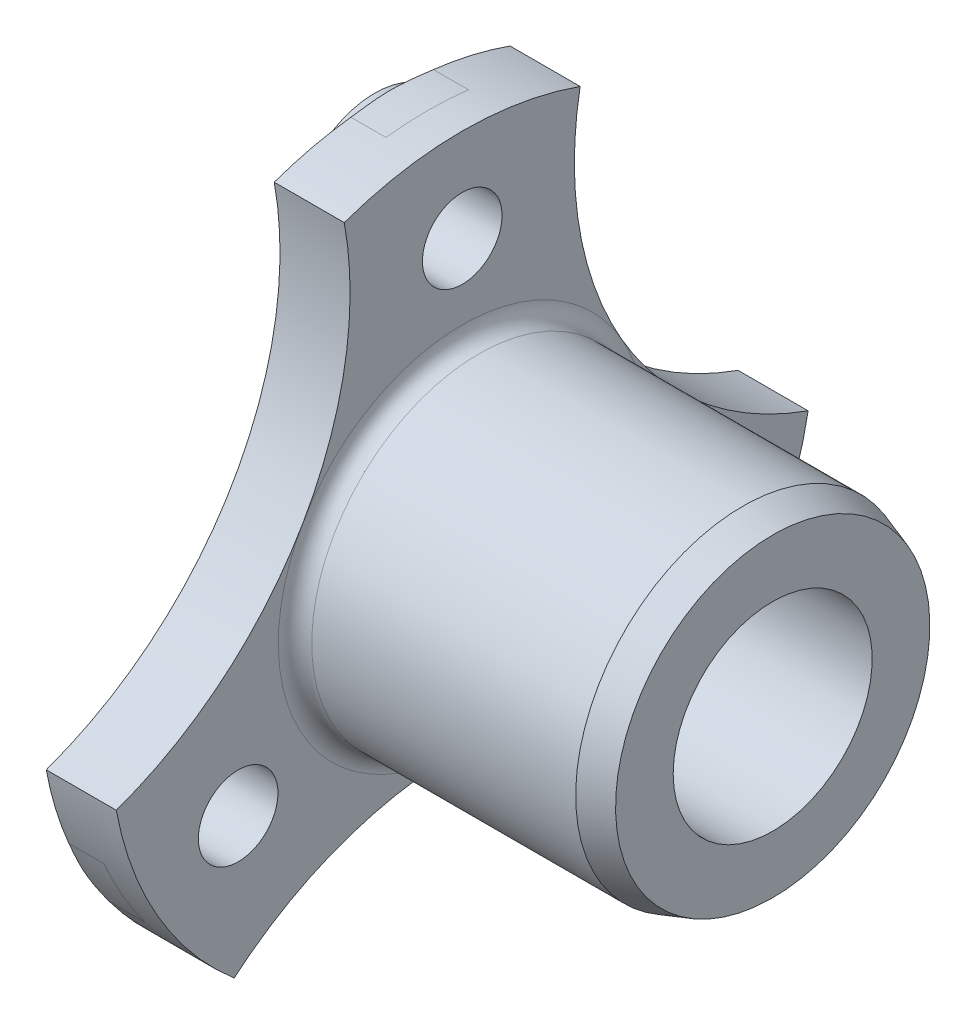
ISO-10303-21;
HEADER;
FILE_DESCRIPTION(('STEP AP214'),'2;1');
FILE_NAME('part.step','',(''),(''),'','','');
FILE_SCHEMA(('AUTOMOTIVE_DESIGN { 1 0 10303 214 1 1 1 1 }'));
ENDSEC;
DATA;
#1=APPLICATION_CONTEXT('core data for automotive mechanical design processes');
#2=APPLICATION_PROTOCOL_DEFINITION('international standard','automotive_design',2000,#1);
#3=PRODUCT_CONTEXT('',#1,'mechanical');
#4=PRODUCT('Part','Part','',(#3));
#5=PRODUCT_RELATED_PRODUCT_CATEGORY('part','',(#4));
#6=PRODUCT_DEFINITION_FORMATION('','',#4);
#7=PRODUCT_DEFINITION_CONTEXT('part definition',#1,'design');
#8=PRODUCT_DEFINITION('design','',#6,#7);
#9=PRODUCT_DEFINITION_SHAPE('','',#8);
#10=(LENGTH_UNIT() NAMED_UNIT(*) SI_UNIT(.MILLI.,.METRE.));
#11=(NAMED_UNIT(*) PLANE_ANGLE_UNIT() SI_UNIT($,.RADIAN.));
#12=(NAMED_UNIT(*) SI_UNIT($,.STERADIAN.) SOLID_ANGLE_UNIT());
#13=UNCERTAINTY_MEASURE_WITH_UNIT(LENGTH_MEASURE(1.E-05),#10,'distance_accuracy_value','');
#14=(GEOMETRIC_REPRESENTATION_CONTEXT(3) GLOBAL_UNCERTAINTY_ASSIGNED_CONTEXT((#13)) GLOBAL_UNIT_ASSIGNED_CONTEXT((#10,
#11,#12)) REPRESENTATION_CONTEXT('',''));
#15=CARTESIAN_POINT('',(0.,0.,0.));
#16=DIRECTION('',(0.,0.,1.));
#17=DIRECTION('',(1.,0.,0.));
#18=AXIS2_PLACEMENT_3D('',#15,#16,#17);
#19=CARTESIAN_POINT('',(15.,32.5,0.));
#20=DIRECTION('',(1.,0.,0.));
#21=DIRECTION('',(0.,0.,-1.));
#22=AXIS2_PLACEMENT_3D('',#19,#20,#21);
#23=TOROIDAL_SURFACE('',#22,12.5,2.2);
#24=CARTESIAN_POINT('',(15.,32.5,0.));
#25=DIRECTION('',(1.,0.,0.));
#26=DIRECTION('',(0.,0.,-1.));
#27=AXIS2_PLACEMENT_3D('',#24,#25,#26);
#28=CIRCLE('',#27,10.3);
#29=CARTESIAN_POINT('',(15.,32.5,-10.3));
#30=VERTEX_POINT('',#29);
#31=EDGE_CURVE('E347',#30,#30,#28,.T.);
#32=ORIENTED_EDGE('',*,*,#31,.T.);
#33=EDGE_LOOP('',(#32));
#34=FACE_BOUND('',#33,.T.);
#35=CARTESIAN_POINT('',(17.2,32.5,0.));
#36=DIRECTION('',(1.,0.,0.));
#37=DIRECTION('',(0.,1.,0.));
#38=AXIS2_PLACEMENT_3D('',#35,#36,#37);
#39=CIRCLE('',#38,12.5);
#40=CARTESIAN_POINT('',(17.2,43.87496,5.18269090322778));
#41=VERTEX_POINT('',#40);
#42=CARTESIAN_POINT('',(17.2,43.87496,-5.18269090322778));
#43=VERTEX_POINT('',#42);
#44=EDGE_CURVE('E206',#41,#43,#39,.T.);
#45=ORIENTED_EDGE('',*,*,#44,.F.);
#46=CARTESIAN_POINT('',(14.9999998,42.9543446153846,10.3342478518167));
#47=CARTESIAN_POINT('',(15.0340599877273,42.9543426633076,10.3342548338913));
#48=CARTESIAN_POINT('',(15.0681012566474,42.9547026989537,10.3327595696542));
#49=CARTESIAN_POINT('',(15.1358868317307,42.9561262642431,10.3268403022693));
#50=CARTESIAN_POINT('',(15.1696313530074,42.9571892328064,10.3224186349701));
#51=CARTESIAN_POINT('',(15.2695065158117,42.9613773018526,10.304979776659));
#52=CARTESIAN_POINT('',(15.3349036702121,42.9655023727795,10.2877856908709));
#53=CARTESIAN_POINT('',(15.4618106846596,42.9760435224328,10.2436606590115));
#54=CARTESIAN_POINT('',(15.5233312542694,42.9824529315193,10.2167580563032));
#55=CARTESIAN_POINT('',(15.6420208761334,42.9971170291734,10.154868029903));
#56=CARTESIAN_POINT('',(15.6991802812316,43.0053756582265,10.1198633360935));
#57=CARTESIAN_POINT('',(15.8454694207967,43.0292930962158,10.0178134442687));
#58=CARTESIAN_POINT('',(15.9303701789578,43.0462035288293,9.94501146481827));
#59=CARTESIAN_POINT('',(16.0876960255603,43.0823088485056,9.78742264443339));
#60=CARTESIAN_POINT('',(16.1600805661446,43.1015108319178,9.70259841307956));
#61=CARTESIAN_POINT('',(16.2844044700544,43.1383352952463,9.5374300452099));
#62=CARTESIAN_POINT('',(16.3377873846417,43.155803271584,9.45811757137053));
#63=CARTESIAN_POINT('',(16.4373941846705,43.1911926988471,9.29517245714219));
#64=CARTESIAN_POINT('',(16.4836125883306,43.2091144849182,9.21153657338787));
#65=CARTESIAN_POINT('',(16.5697502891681,43.2450908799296,9.0411337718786));
#66=CARTESIAN_POINT('',(16.6096691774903,43.2631454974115,8.95436665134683));
#67=CARTESIAN_POINT('',(16.6839826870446,43.2991799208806,8.77846781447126));
#68=CARTESIAN_POINT('',(16.7183751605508,43.3171596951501,8.68933519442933));
#69=CARTESIAN_POINT('',(16.8156669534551,43.3715316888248,8.41532688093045));
#70=CARTESIAN_POINT('',(16.8708502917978,43.407553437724,8.22762660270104));
#71=CARTESIAN_POINT('',(16.9653131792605,43.4778141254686,7.84789838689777));
#72=CARTESIAN_POINT('',(17.0045749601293,43.512051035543,7.65586586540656));
#73=CARTESIAN_POINT('',(17.0705331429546,43.5784707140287,7.26829649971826));
#74=CARTESIAN_POINT('',(17.0971639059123,43.6106420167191,7.07274671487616));
#75=CARTESIAN_POINT('',(17.1293699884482,43.6570219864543,6.77840000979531));
#76=CARTESIAN_POINT('',(17.1388137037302,43.6721649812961,6.6801430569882));
#77=CARTESIAN_POINT('',(17.1553939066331,43.7018135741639,6.48334703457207));
#78=CARTESIAN_POINT('',(17.1625306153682,43.71631923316,6.38480799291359));
#79=CARTESIAN_POINT('',(17.1829598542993,43.7637128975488,6.055105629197));
#80=CARTESIAN_POINT('',(17.1916587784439,43.7951430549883,5.82344367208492));
#81=CARTESIAN_POINT('',(17.2006654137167,43.8543405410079,5.35947300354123));
#82=CARTESIAN_POINT('',(17.2009708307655,43.8821068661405,5.12716413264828));
#83=CARTESIAN_POINT('',(17.1956428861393,43.9339653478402,4.66196560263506));
#84=CARTESIAN_POINT('',(17.1900031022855,43.9580534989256,4.42907558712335));
#85=CARTESIAN_POINT('',(17.1750033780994,44.0025154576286,3.96305816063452));
#86=CARTESIAN_POINT('',(17.1656431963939,44.022889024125,3.72993073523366));
#87=CARTESIAN_POINT('',(17.1452238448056,44.0599623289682,3.26298694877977));
#88=CARTESIAN_POINT('',(17.13416127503,44.0766545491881,3.02917014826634));
#89=CARTESIAN_POINT('',(17.1122194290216,44.1063164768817,2.5612878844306));
#90=CARTESIAN_POINT('',(17.1013401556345,44.1192861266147,2.32722241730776));
#91=CARTESIAN_POINT('',(17.0814037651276,44.1414915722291,1.8590312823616));
#92=CARTESIAN_POINT('',(17.0723451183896,44.1507305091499,1.62490583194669));
#93=CARTESIAN_POINT('',(17.0573298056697,44.1654838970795,1.15643789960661));
#94=CARTESIAN_POINT('',(17.0513730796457,44.1709984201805,0.922095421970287));
#95=CARTESIAN_POINT('',(17.0434025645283,44.178292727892,0.453533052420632));
#96=CARTESIAN_POINT('',(17.0413845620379,44.1800765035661,0.219313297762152));
#97=CARTESIAN_POINT('',(17.0415611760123,44.1799184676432,-0.249124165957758));
#98=CARTESIAN_POINT('',(17.0437558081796,44.1779766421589,-0.483341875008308));
#99=CARTESIAN_POINT('',(17.0520527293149,44.1703683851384,-0.951764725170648));
#100=CARTESIAN_POINT('',(17.0581570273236,44.1647000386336,-1.18596979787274));
#101=CARTESIAN_POINT('',(17.07341822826,44.1496435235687,-1.65415716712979));
#102=CARTESIAN_POINT('',(17.0825751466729,44.1402553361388,-1.88813946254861));
#103=CARTESIAN_POINT('',(17.1026313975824,44.1177707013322,-2.35573140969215));
#104=CARTESIAN_POINT('',(17.1135298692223,44.1046760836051,-2.58934118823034));
#105=CARTESIAN_POINT('',(17.1354403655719,44.0747780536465,-3.05631803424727));
#106=CARTESIAN_POINT('',(17.1464523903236,44.0579746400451,-3.28968510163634));
#107=CARTESIAN_POINT('',(17.166719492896,44.0206633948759,-3.7561024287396));
#108=CARTESIAN_POINT('',(17.1759753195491,44.000157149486,-3.98915278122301));
#109=CARTESIAN_POINT('',(17.1906901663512,43.955432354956,-4.4550093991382));
#110=CARTESIAN_POINT('',(17.1961495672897,43.9312141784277,-4.68781568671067));
#111=CARTESIAN_POINT('',(17.2001641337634,43.8883448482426,-5.07033899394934));
#112=CARTESIAN_POINT('',(17.2004843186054,43.8707773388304,-5.22015782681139));
#113=CARTESIAN_POINT('',(17.1979650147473,43.8341126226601,-5.51957572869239));
#114=CARTESIAN_POINT('',(17.195125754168,43.8150155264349,-5.66917481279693));
#115=CARTESIAN_POINT('',(17.1855757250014,43.7752745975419,-5.96829381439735));
#116=CARTESIAN_POINT('',(17.1788587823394,43.7546283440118,-6.11781322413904));
#117=CARTESIAN_POINT('',(17.1607646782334,43.7118450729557,-6.41636516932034));
#118=CARTESIAN_POINT('',(17.1493874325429,43.6897080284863,-6.56539769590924));
#119=CARTESIAN_POINT('',(17.1184071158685,43.6396508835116,-6.89095707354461));
#120=CARTESIAN_POINT('',(17.097652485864,43.6114307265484,-7.06733246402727));
#121=CARTESIAN_POINT('',(17.046567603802,43.5530923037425,-7.41836824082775));
#122=CARTESIAN_POINT('',(17.0162396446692,43.5229744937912,-7.59302902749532));
#123=CARTESIAN_POINT('',(16.9439672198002,43.4611672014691,-7.93915349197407));
#124=CARTESIAN_POINT('',(16.9020566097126,43.4294825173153,-8.11062495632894));
#125=CARTESIAN_POINT('',(16.8039083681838,43.3648996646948,-8.44911000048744));
#126=CARTESIAN_POINT('',(16.7476871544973,43.3320029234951,-8.6161284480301));
#127=CARTESIAN_POINT('',(16.6370851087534,43.2757906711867,-8.89336086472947));
#128=CARTESIAN_POINT('',(16.5873241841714,43.2525973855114,-9.005430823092));
#129=CARTESIAN_POINT('',(16.4774182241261,43.2063769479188,-9.2246365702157));
#130=CARTESIAN_POINT('',(16.4172631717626,43.1833499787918,-9.33176747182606));
#131=CARTESIAN_POINT('',(16.2841080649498,43.1379636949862,-9.53938528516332));
#132=CARTESIAN_POINT('',(16.2110001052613,43.1156119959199,-9.63980577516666));
#133=CARTESIAN_POINT('',(16.0500882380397,43.0729491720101,-9.82866936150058));
#134=CARTESIAN_POINT('',(15.9623215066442,43.0526330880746,-9.91714175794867));
#135=CARTESIAN_POINT('',(15.8078521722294,43.0230651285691,-10.0444393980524));
#136=CARTESIAN_POINT('',(15.7462751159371,43.0125874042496,-10.08917395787));
#137=CARTESIAN_POINT('',(15.6170293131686,42.9936804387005,-10.1694412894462));
#138=CARTESIAN_POINT('',(15.5493649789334,42.9852497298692,-10.2049806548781));
#139=CARTESIAN_POINT('',(15.4168648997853,42.9719258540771,-10.2609318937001));
#140=CARTESIAN_POINT('',(15.3526011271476,42.9667370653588,-10.2826147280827));
#141=CARTESIAN_POINT('',(15.2213061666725,42.9589430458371,-10.3151302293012));
#142=CARTESIAN_POINT('',(15.1542821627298,42.9563315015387,-10.3259894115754));
#143=CARTESIAN_POINT('',(15.0579529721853,42.9546012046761,-10.3331805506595));
#144=CARTESIAN_POINT('',(15.0289709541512,42.9543394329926,-10.334267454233));
#145=CARTESIAN_POINT('',(14.9999998,42.9543446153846,-10.3342478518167));
#146=B_SPLINE_CURVE_WITH_KNOTS('',3,(#46,#47,#48,#49,#50,#51,#52,#53,#54,#55,#56,#57,#58,#59,
#60,#61,#62,#63,#64,#65,#66,#67,#68,#69,#70,#71,#72,#73,#74,#75,#76,#77,#78,#79,#80,#81,#82,#83,
#84,#85,#86,#87,#88,#89,#90,#91,#92,#93,#94,#95,#96,#97,#98,#99,#100,#101,#102,#103,#104,#105,
#106,#107,#108,#109,#110,#111,#112,#113,#114,#115,#116,#117,#118,#119,#120,#121,#122,#123,#124,
#125,#126,#127,#128,#129,#130,#131,#132,#133,#134,#135,#136,#137,#138,#139,#140,#141,#142,#143,
#144,#145),.UNSPECIFIED.,.F.,.F.,(4,2,2,2,2,2,2,2,2,2,2,2,2,2,2,2,2,2,2,2,2,2,2,2,2,2,2,2,2,2,2,
2,2,2,2,2,2,2,2,2,2,2,2,2,2,2,2,2,2,4),(0.,0.102110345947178,0.204139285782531,
0.406348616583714,0.607972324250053,0.810029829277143,1.14742165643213,1.48588682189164,
1.7770315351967,2.06839792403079,2.35978321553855,2.65128147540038,3.24704691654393,
3.843475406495,4.44297025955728,4.74254209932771,5.04208521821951,5.74365582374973,
6.44541817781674,7.1479393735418,7.85050615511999,8.55449471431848,9.25849419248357,
9.96189970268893,10.665291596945,11.3679306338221,12.0705722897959,12.7735752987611,
13.476581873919,14.1792420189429,14.8819024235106,15.5842625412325,16.2865522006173,
16.7390560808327,17.1915272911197,17.6447209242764,18.0979227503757,18.6371598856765,
19.1762679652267,19.7138166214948,20.2507513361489,20.6247296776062,20.9990704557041,
21.3766904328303,21.7533668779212,21.9832091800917,22.2128862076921,22.4161071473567,
22.6188290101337,22.7057547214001),.UNSPECIFIED.);
#147=EDGE_CURVE('E245',#41,#43,#146,.T.);
#148=ORIENTED_EDGE('',*,*,#147,.T.);
#149=EDGE_LOOP('',(#45,#148));
#150=FACE_BOUND('',#149,.T.);
#151=ADVANCED_FACE('F12',(#34,#150),#23,.F.);
#152=CARTESIAN_POINT('',(15.,-16.25,28.1458256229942));
#153=DIRECTION('',(1.,0.,0.));
#154=DIRECTION('',(0.,0.866025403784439,0.5));
#155=AXIS2_PLACEMENT_3D('',#152,#153,#154);
#156=TOROIDAL_SURFACE('',#155,12.5,2.2);
#157=CARTESIAN_POINT('',(15.,-16.25,28.1458256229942));
#158=DIRECTION('',(1.,0.,0.));
#159=DIRECTION('',(0.,0.866025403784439,0.5));
#160=AXIS2_PLACEMENT_3D('',#157,#158,#159);
#161=CIRCLE('',#160,10.3);
#162=CARTESIAN_POINT('',(15.,-7.32993834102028,33.2958256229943));
#163=VERTEX_POINT('',#162);
#164=EDGE_CURVE('E376',#163,#163,#161,.T.);
#165=ORIENTED_EDGE('',*,*,#164,.T.);
#166=EDGE_LOOP('',(#165));
#167=FACE_BOUND('',#166,.T.);
#168=CARTESIAN_POINT('',(17.2,-16.25,28.1458256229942));
#169=DIRECTION('',(1.,0.,0.));
#170=DIRECTION('',(0.,1.,0.));
#171=AXIS2_PLACEMENT_3D('',#168,#169,#170);
#172=CIRCLE('',#171,12.5);
#173=CARTESIAN_POINT('',(17.2,-26.4258219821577,35.4054844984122));
#174=VERTEX_POINT('',#173);
#175=CARTESIAN_POINT('',(17.2,-17.4491380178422,40.58817540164));
#176=VERTEX_POINT('',#175);
#177=EDGE_CURVE('E212',#174,#176,#172,.T.);
#178=ORIENTED_EDGE('',*,*,#177,.F.);
#179=CARTESIAN_POINT('',(16.8956573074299,-28.7500002,33.5456388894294));
#180=CARTESIAN_POINT('',(16.9314040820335,-28.6448602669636,33.6357532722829));
#181=CARTESIAN_POINT('',(16.9629279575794,-28.5385209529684,33.7260281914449));
#182=CARTESIAN_POINT('',(17.0186376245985,-28.3239515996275,33.9064256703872));
#183=CARTESIAN_POINT('',(17.0428294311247,-28.2157231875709,33.9965482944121));
#184=CARTESIAN_POINT('',(17.0849400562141,-27.9982139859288,34.1759011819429));
#185=CARTESIAN_POINT('',(17.1028873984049,-27.8889403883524,34.2651336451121));
#186=CARTESIAN_POINT('',(17.1335484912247,-27.6690813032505,34.4429141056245));
#187=CARTESIAN_POINT('',(17.1462610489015,-27.5584955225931,34.5314619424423));
#188=CARTESIAN_POINT('',(17.1776384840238,-27.2261027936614,34.7949910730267));
#189=CARTESIAN_POINT('',(17.1897217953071,-27.0026549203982,34.9686873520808));
#190=CARTESIAN_POINT('',(17.2014664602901,-26.5519748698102,35.31211535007));
#191=CARTESIAN_POINT('',(17.201108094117,-26.3247372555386,35.4818403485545));
#192=CARTESIAN_POINT('',(17.1934058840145,-25.9265930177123,35.7732893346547));
#193=CARTESIAN_POINT('',(17.1879006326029,-25.7563856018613,35.8960305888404));
#194=CARTESIAN_POINT('',(17.1740127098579,-25.4143161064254,36.1390225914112));
#195=CARTESIAN_POINT('',(17.1656299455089,-25.2424539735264,36.2592732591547));
#196=CARTESIAN_POINT('',(17.1474543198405,-24.8970306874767,36.4973187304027));
#197=CARTESIAN_POINT('',(17.1376609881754,-24.7234689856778,36.615112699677));
#198=CARTESIAN_POINT('',(17.1180174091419,-24.3746938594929,36.8482115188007));
#199=CARTESIAN_POINT('',(17.1081671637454,-24.1994804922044,36.963516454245));
#200=CARTESIAN_POINT('',(17.0896164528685,-23.8474194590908,37.1916250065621));
#201=CARTESIAN_POINT('',(17.0809157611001,-23.6705721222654,37.3044291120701));
#202=CARTESIAN_POINT('',(17.0656684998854,-23.3152199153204,37.527548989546));
#203=CARTESIAN_POINT('',(17.0591219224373,-23.1367150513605,37.6378647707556));
#204=CARTESIAN_POINT('',(17.0489265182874,-22.7781530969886,37.8559394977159));
#205=CARTESIAN_POINT('',(17.0452766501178,-22.5980965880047,37.9636993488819));
#206=CARTESIAN_POINT('',(17.0412818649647,-22.2364384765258,38.1766583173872));
#207=CARTESIAN_POINT('',(17.0409369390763,-22.0548368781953,38.2818574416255));
#208=CARTESIAN_POINT('',(17.0436029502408,-21.6885599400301,38.4905649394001));
#209=CARTESIAN_POINT('',(17.0466435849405,-21.503871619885,38.5940501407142));
#210=CARTESIAN_POINT('',(17.0557802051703,-21.1330865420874,38.7983228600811));
#211=CARTESIAN_POINT('',(17.0618761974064,-20.9469897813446,38.8991103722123));
#212=CARTESIAN_POINT('',(17.0764250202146,-20.5733724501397,39.0979993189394));
#213=CARTESIAN_POINT('',(17.0848787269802,-20.385851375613,39.196099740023));
#214=CARTESIAN_POINT('',(17.1031524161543,-20.0094713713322,39.389570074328));
#215=CARTESIAN_POINT('',(17.1129724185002,-19.8206124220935,39.4849399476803));
#216=CARTESIAN_POINT('',(17.1328170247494,-19.4407127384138,39.6733694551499));
#217=CARTESIAN_POINT('',(17.1428423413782,-19.2496660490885,39.766417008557));
#218=CARTESIAN_POINT('',(17.161669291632,-18.8662124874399,39.9497633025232));
#219=CARTESIAN_POINT('',(17.1704710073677,-18.673805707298,40.0400622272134));
#220=CARTESIAN_POINT('',(17.1853467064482,-18.2876864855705,40.2178825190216));
#221=CARTESIAN_POINT('',(17.19142175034,-18.0939745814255,40.3054049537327));
#222=CARTESIAN_POINT('',(17.1991859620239,-17.7051902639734,40.4776959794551));
#223=CARTESIAN_POINT('',(17.200874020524,-17.5101175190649,40.562463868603));
#224=CARTESIAN_POINT('',(17.199534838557,-17.3144229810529,40.6458258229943));
#225=B_SPLINE_CURVE_WITH_KNOTS('',3,(#179,#180,#181,#182,#183,#184,#185,#186,#187,#188,#189,
#190,#191,#192,#193,#194,#195,#196,#197,#198,#199,#200,#201,#202,#203,#204,#205,#206,#207,#208,
#209,#210,#211,#212,#213,#214,#215,#216,#217,#218,#219,#220,#221,#222,#223,#224),.UNSPECIFIED.,
.F.,.F.,(4,2,2,2,2,2,2,2,2,2,2,2,2,2,2,2,2,2,2,2,2,2,4),(0.,0.428867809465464,0.857382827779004,
1.28391394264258,1.71054220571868,2.55986049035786,3.41052499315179,4.04023702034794,
4.66996940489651,5.29991225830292,5.92983341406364,6.55963038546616,7.18942501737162,
7.81899311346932,8.44855951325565,9.08369219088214,9.71882626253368,10.3541966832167,
10.9895763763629,11.6277657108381,12.2659121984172,12.9038102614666,13.5418696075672),.UNSPECIFIED.);
#226=EDGE_CURVE('E239',#174,#176,#225,.T.);
#227=ORIENTED_EDGE('',*,*,#226,.T.);
#228=EDGE_LOOP('',(#178,#227));
#229=FACE_BOUND('',#228,.T.);
#230=ADVANCED_FACE('F253',(#167,#229),#156,.F.);
#231=CARTESIAN_POINT('',(15.,-16.25,-28.1458256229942));
#232=DIRECTION('',(1.,0.,0.));
#233=DIRECTION('',(0.,-0.866025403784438,0.5));
#234=AXIS2_PLACEMENT_3D('',#231,#232,#233);
#235=TOROIDAL_SURFACE('',#234,12.5,2.2);
#236=CARTESIAN_POINT('',(15.,-16.25,-28.1458256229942));
#237=DIRECTION('',(1.,0.,0.));
#238=DIRECTION('',(0.,-0.866025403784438,0.5));
#239=AXIS2_PLACEMENT_3D('',#236,#237,#238);
#240=CIRCLE('',#239,10.3);
#241=CARTESIAN_POINT('',(15.,-25.1700616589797,-22.9958256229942));
#242=VERTEX_POINT('',#241);
#243=EDGE_CURVE('E137',#242,#242,#240,.T.);
#244=ORIENTED_EDGE('',*,*,#243,.T.);
#245=EDGE_LOOP('',(#244));
#246=FACE_BOUND('',#245,.T.);
#247=CARTESIAN_POINT('',(17.2,-16.25,-28.1458256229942));
#248=DIRECTION('',(1.,0.,0.));
#249=DIRECTION('',(0.,1.,0.));
#250=AXIS2_PLACEMENT_3D('',#247,#248,#249);
#251=CIRCLE('',#250,12.5);
#252=CARTESIAN_POINT('',(17.2,-17.4491380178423,-40.58817540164));
#253=VERTEX_POINT('',#252);
#254=CARTESIAN_POINT('',(17.2,-26.4258219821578,-35.4054844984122));
#255=VERTEX_POINT('',#254);
#256=EDGE_CURVE('E124',#253,#255,#251,.T.);
#257=ORIENTED_EDGE('',*,*,#256,.F.);
#258=CARTESIAN_POINT('',(17.199534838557,-17.3144229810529,-40.6458258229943));
#259=CARTESIAN_POINT('',(17.2006985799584,-17.4833212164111,-40.5738784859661));
#260=CARTESIAN_POINT('',(17.1995977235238,-17.6517622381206,-40.5008813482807));
#261=CARTESIAN_POINT('',(17.1939541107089,-17.9876433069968,-40.3528283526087));
#262=CARTESIAN_POINT('',(17.1894120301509,-18.1550835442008,-40.2777729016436));
#263=CARTESIAN_POINT('',(17.1779700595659,-18.489024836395,-40.1255785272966));
#264=CARTESIAN_POINT('',(17.1710690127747,-18.6555253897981,-40.0484385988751));
#265=CARTESIAN_POINT('',(17.155902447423,-18.9875093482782,-39.8921114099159));
#266=CARTESIAN_POINT('',(17.147636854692,-19.1529926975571,-39.8129240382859));
#267=CARTESIAN_POINT('',(17.1306530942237,-19.4833327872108,-39.6523133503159));
#268=CARTESIAN_POINT('',(17.1219338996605,-19.6481871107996,-39.5708851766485));
#269=CARTESIAN_POINT('',(17.1049198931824,-19.9768807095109,-39.4059696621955));
#270=CARTESIAN_POINT('',(17.0966250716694,-20.1407200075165,-39.3224823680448));
#271=CARTESIAN_POINT('',(17.0812240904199,-20.467276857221,-39.1535024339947));
#272=CARTESIAN_POINT('',(17.0741171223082,-20.6299950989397,-39.068011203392));
#273=CARTESIAN_POINT('',(17.0617124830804,-20.954411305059,-38.8949719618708));
#274=CARTESIAN_POINT('',(17.0564148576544,-21.1161092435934,-38.8074238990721));
#275=CARTESIAN_POINT('',(17.0484843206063,-21.4231262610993,-38.6387080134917));
#276=CARTESIAN_POINT('',(17.0456459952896,-21.5685413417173,-38.5577246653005));
#277=CARTESIAN_POINT('',(17.0420274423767,-21.8584678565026,-38.3941074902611));
#278=CARTESIAN_POINT('',(17.0412472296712,-22.0029792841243,-38.3114736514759));
#279=CARTESIAN_POINT('',(17.0418026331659,-22.2910579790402,-38.1445781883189));
#280=CARTESIAN_POINT('',(17.0431382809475,-22.4346252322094,-38.0603165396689));
#281=CARTESIAN_POINT('',(17.0478237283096,-22.7207747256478,-37.8901900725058));
#282=CARTESIAN_POINT('',(17.0511735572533,-22.8633569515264,-37.8043252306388));
#283=CARTESIAN_POINT('',(17.0639422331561,-23.290186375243,-37.5439857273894));
#284=CARTESIAN_POINT('',(17.0760775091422,-23.5728996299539,-37.367123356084));
#285=CARTESIAN_POINT('',(17.1042089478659,-24.1340918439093,-37.0071501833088));
#286=CARTESIAN_POINT('',(17.120205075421,-24.4125708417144,-36.8240394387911));
#287=CARTESIAN_POINT('',(17.1510503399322,-24.9624936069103,-36.4534647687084));
#288=CARTESIAN_POINT('',(17.1659096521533,-25.2339803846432,-36.2660656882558));
#289=CARTESIAN_POINT('',(17.1891467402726,-25.7729801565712,-35.8850228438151));
#290=CARTESIAN_POINT('',(17.1975224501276,-26.0404918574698,-35.6913771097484));
#291=CARTESIAN_POINT('',(17.2015490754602,-26.5703298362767,-35.2986999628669));
#292=CARTESIAN_POINT('',(17.1972447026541,-26.8326710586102,-35.0996899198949));
#293=CARTESIAN_POINT('',(17.1758693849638,-27.2222068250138,-34.7972827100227));
#294=CARTESIAN_POINT('',(17.1662636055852,-27.3513462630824,-34.6958666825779));
#295=CARTESIAN_POINT('',(17.1410007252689,-27.6081161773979,-34.491900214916));
#296=CARTESIAN_POINT('',(17.1253448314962,-27.7357469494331,-34.3893500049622));
#297=CARTESIAN_POINT('',(17.0945733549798,-27.937837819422,-34.2251231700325));
#298=CARTESIAN_POINT('',(17.081810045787,-28.0128844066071,-34.1637244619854));
#299=CARTESIAN_POINT('',(17.0534021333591,-28.1622724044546,-34.040684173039));
#300=CARTESIAN_POINT('',(17.0377566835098,-28.2366136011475,-33.9790425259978));
#301=CARTESIAN_POINT('',(17.0031938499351,-28.3847307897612,-33.8554100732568));
#302=CARTESIAN_POINT('',(16.9842645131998,-28.4585036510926,-33.7934188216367));
#303=CARTESIAN_POINT('',(16.9427794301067,-28.6050447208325,-33.6694676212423));
#304=CARTESIAN_POINT('',(16.9202237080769,-28.6778129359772,-33.6075076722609));
#305=CARTESIAN_POINT('',(16.8956573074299,-28.7500002,-33.5456388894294));
#306=B_SPLINE_CURVE_WITH_KNOTS('',3,(#258,#259,#260,#261,#262,#263,#264,#265,#266,#267,#268,
#269,#270,#271,#272,#273,#274,#275,#276,#277,#278,#279,#280,#281,#282,#283,#284,#285,#286,#287,
#288,#289,#290,#291,#292,#293,#294,#295,#296,#297,#298,#299,#300,#301,#302,#303,#304,#305),
.UNSPECIFIED.,.F.,.F.,(4,2,2,2,2,2,2,2,2,2,2,2,2,2,2,2,2,2,2,2,2,2,2,4),(0.,0.550711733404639,
1.10131534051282,1.65218933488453,2.20309328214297,2.75530373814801,3.30750169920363,
3.85932232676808,4.41115688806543,4.91054155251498,5.40992983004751,5.90932556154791,
6.40872857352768,7.40967169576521,8.41060569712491,9.40115860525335,10.3920270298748,
11.379405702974,11.8727603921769,12.3660166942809,12.6593766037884,12.9528228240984,
13.2473604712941,13.5418961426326),.UNSPECIFIED.);
#307=EDGE_CURVE('E9',#253,#255,#306,.T.);
#308=ORIENTED_EDGE('',*,*,#307,.T.);
#309=EDGE_LOOP('',(#257,#308));
#310=FACE_BOUND('',#309,.T.);
#311=ADVANCED_FACE('F125',(#246,#310),#235,.F.);
#312=CARTESIAN_POINT('',(26.,16.82,-29.1330945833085));
#313=DIRECTION('',(1.,0.,0.));
#314=DIRECTION('',(0.,0.866025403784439,-0.5));
#315=AXIS2_PLACEMENT_3D('',#312,#313,#314);
#316=PLANE('',#315);
#317=CARTESIAN_POINT('',(26.,-16.25,-28.1458256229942));
#318=DIRECTION('',(1.,0.,0.));
#319=DIRECTION('',(0.,1.,0.));
#320=AXIS2_PLACEMENT_3D('',#317,#318,#319);
#321=CIRCLE('',#320,5.);
#322=CARTESIAN_POINT('',(26.,-11.25,-28.1458256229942));
#323=VERTEX_POINT('',#322);
#324=EDGE_CURVE('E401',#323,#323,#321,.T.);
#325=ORIENTED_EDGE('',*,*,#324,.F.);
#326=EDGE_LOOP('',(#325));
#327=FACE_BOUND('',#326,.T.);
#328=CARTESIAN_POINT('',(26.,33.64,-58.266189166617));
#329=DIRECTION('',(1.,0.,0.));
#330=DIRECTION('',(0.,0.5,0.866025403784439));
#331=AXIS2_PLACEMENT_3D('',#328,#329,#330);
#332=CIRCLE('',#331,44.18);
#333=CARTESIAN_POINT('',(26.,11.55,-20.0051868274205));
#334=VERTEX_POINT('',#333);
#335=CARTESIAN_POINT('',(26.,-7.98256236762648,-43.4528606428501));
#336=VERTEX_POINT('',#335);
#337=EDGE_CURVE('E165',#334,#336,#332,.T.);
#338=ORIENTED_EDGE('',*,*,#337,.F.);
#339=CARTESIAN_POINT('',(26.,0.,0.));
#340=DIRECTION('',(1.,0.,0.));
#341=DIRECTION('',(0.,0.866025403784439,-0.5));
#342=AXIS2_PLACEMENT_3D('',#339,#340,#341);
#343=CIRCLE('',#342,23.1);
#344=CARTESIAN_POINT('',(26.,-23.1,0.));
#345=VERTEX_POINT('',#344);
#346=EDGE_CURVE('E202',#334,#345,#343,.F.);
#347=ORIENTED_EDGE('',*,*,#346,.T.);
#348=CARTESIAN_POINT('',(26.,-67.28,0.));
#349=DIRECTION('',(1.,0.,0.));
#350=DIRECTION('',(0.,0.5,0.866025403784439));
#351=AXIS2_PLACEMENT_3D('',#348,#349,#350);
#352=CIRCLE('',#351,44.18);
#353=CARTESIAN_POINT('',(26.,-33.64,-28.6395321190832));
#354=VERTEX_POINT('',#353);
#355=EDGE_CURVE('E172',#354,#345,#352,.T.);
#356=ORIENTED_EDGE('',*,*,#355,.F.);
#357=CARTESIAN_POINT('',(26.,0.,0.));
#358=DIRECTION('',(1.,0.,0.));
#359=DIRECTION('',(0.,0.5,0.866025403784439));
#360=AXIS2_PLACEMENT_3D('',#357,#358,#359);
#361=CIRCLE('',#360,44.18);
#362=EDGE_CURVE('E167',#354,#336,#361,.T.);
#363=ORIENTED_EDGE('',*,*,#362,.T.);
#364=EDGE_LOOP('',(#338,#347,#356,#363));
#365=FACE_BOUND('',#364,.T.);
#366=ADVANCED_FACE('F289',(#327,#365),#316,.T.);
#367=CARTESIAN_POINT('',(26.,-16.25,28.1458256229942));
#368=DIRECTION('',(1.,0.,0.));
#369=DIRECTION('',(0.,1.,0.));
#370=AXIS2_PLACEMENT_3D('',#367,#368,#369);
#371=CIRCLE('',#370,5.);
#372=CARTESIAN_POINT('',(26.,-11.25,28.1458256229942));
#373=VERTEX_POINT('',#372);
#374=EDGE_CURVE('E396',#373,#373,#371,.T.);
#375=ORIENTED_EDGE('',*,*,#374,.F.);
#376=EDGE_LOOP('',(#375));
#377=FACE_BOUND('',#376,.T.);
#378=CARTESIAN_POINT('',(26.,-33.64,28.6395321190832));
#379=VERTEX_POINT('',#378);
#380=EDGE_CURVE('E170',#345,#379,#352,.T.);
#381=ORIENTED_EDGE('',*,*,#380,.F.);
#382=CARTESIAN_POINT('',(26.,11.55,20.0051868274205));
#383=VERTEX_POINT('',#382);
#384=EDGE_CURVE('E200',#345,#383,#343,.F.);
#385=ORIENTED_EDGE('',*,*,#384,.T.);
#386=CARTESIAN_POINT('',(26.,33.64,58.266189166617));
#387=DIRECTION('',(1.,0.,0.));
#388=DIRECTION('',(0.,0.5,0.866025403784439));
#389=AXIS2_PLACEMENT_3D('',#386,#387,#388);
#390=CIRCLE('',#389,44.18);
#391=CARTESIAN_POINT('',(26.,-7.98256236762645,43.4528606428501));
#392=VERTEX_POINT('',#391);
#393=EDGE_CURVE('E179',#392,#383,#390,.T.);
#394=ORIENTED_EDGE('',*,*,#393,.F.);
#395=CARTESIAN_POINT('',(26.,0.,0.));
#396=DIRECTION('',(1.,0.,0.));
#397=DIRECTION('',(0.,0.5,0.866025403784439));
#398=AXIS2_PLACEMENT_3D('',#395,#396,#397);
#399=CIRCLE('',#398,44.18);
#400=EDGE_CURVE('E175',#392,#379,#399,.T.);
#401=ORIENTED_EDGE('',*,*,#400,.T.);
#402=EDGE_LOOP('',(#381,#385,#394,#401));
#403=FACE_BOUND('',#402,.T.);
#404=ADVANCED_FACE('F292',(#377,#403),#316,.T.);
#405=CARTESIAN_POINT('',(26.,32.5,0.));
#406=DIRECTION('',(1.,0.,0.));
#407=DIRECTION('',(0.,1.,0.));
#408=AXIS2_PLACEMENT_3D('',#405,#406,#407);
#409=CIRCLE('',#408,5.);
#410=CARTESIAN_POINT('',(26.,37.5,0.));
#411=VERTEX_POINT('',#410);
#412=EDGE_CURVE('E246',#411,#411,#409,.T.);
#413=ORIENTED_EDGE('',*,*,#412,.F.);
#414=EDGE_LOOP('',(#413));
#415=FACE_BOUND('',#414,.T.);
#416=CARTESIAN_POINT('',(26.,41.6225623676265,14.8133285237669));
#417=VERTEX_POINT('',#416);
#418=EDGE_CURVE('E178',#383,#417,#390,.T.);
#419=ORIENTED_EDGE('',*,*,#418,.F.);
#420=CARTESIAN_POINT('',(26.,0.,0.));
#421=DIRECTION('',(-1.,0.,0.));
#422=DIRECTION('',(0.,-0.866025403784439,0.5));
#423=AXIS2_PLACEMENT_3D('',#420,#421,#422);
#424=CIRCLE('',#423,23.1);
#425=EDGE_CURVE('E357',#383,#334,#424,.T.);
#426=ORIENTED_EDGE('',*,*,#425,.T.);
#427=CARTESIAN_POINT('',(26.,41.6225623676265,-14.8133285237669));
#428=VERTEX_POINT('',#427);
#429=EDGE_CURVE('E171',#428,#334,#332,.T.);
#430=ORIENTED_EDGE('',*,*,#429,.F.);
#431=CARTESIAN_POINT('',(26.,0.,0.));
#432=DIRECTION('',(1.,0.,0.));
#433=DIRECTION('',(0.,0.5,0.866025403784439));
#434=AXIS2_PLACEMENT_3D('',#431,#432,#433);
#435=CIRCLE('',#434,44.18);
#436=EDGE_CURVE('E182',#428,#417,#435,.T.);
#437=ORIENTED_EDGE('',*,*,#436,.T.);
#438=EDGE_LOOP('',(#419,#426,#430,#437));
#439=FACE_BOUND('',#438,.T.);
#440=ADVANCED_FACE('F294',(#415,#439),#316,.T.);
#441=CARTESIAN_POINT('',(26.,33.64,-58.266189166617));
#442=DIRECTION('',(-1.,0.,0.));
#443=DIRECTION('',(0.,-0.866025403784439,0.5));
#444=AXIS2_PLACEMENT_3D('',#441,#442,#443);
#445=CYLINDRICAL_SURFACE('',#444,44.18);
#446=CARTESIAN_POINT('',(17.2,33.64,-58.266189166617));
#447=DIRECTION('',(1.,0.,0.));
#448=DIRECTION('',(0.,0.5,0.866025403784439));
#449=AXIS2_PLACEMENT_3D('',#446,#447,#448);
#450=CIRCLE('',#449,44.18);
#451=CARTESIAN_POINT('',(17.2,41.6225623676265,-14.8133285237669));
#452=VERTEX_POINT('',#451);
#453=CARTESIAN_POINT('',(17.2,-7.98256236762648,-43.4528606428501));
#454=VERTEX_POINT('',#453);
#455=EDGE_CURVE('E143',#452,#454,#450,.T.);
#456=ORIENTED_EDGE('',*,*,#455,.F.);
#457=DIRECTION('',(-1.,0.,0.));
#458=VECTOR('',#457,1.);
#459=CARTESIAN_POINT('',(26.,41.6225623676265,-14.8133285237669));
#460=LINE('',#459,#458);
#461=EDGE_CURVE('E185',#428,#452,#460,.T.);
#462=ORIENTED_EDGE('',*,*,#461,.F.);
#463=ORIENTED_EDGE('',*,*,#429,.T.);
#464=DIRECTION('',(-1.,0.,0.));
#465=VECTOR('',#464,1.);
#466=CARTESIAN_POINT('',(25.5,11.55,-20.0051868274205));
#467=LINE('',#466,#465);
#468=CARTESIAN_POINT('',(25.,11.55,-20.0051868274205));
#469=VERTEX_POINT('',#468);
#470=EDGE_CURVE('E151',#334,#469,#467,.T.);
#471=ORIENTED_EDGE('',*,*,#470,.T.);
#472=ORIENTED_EDGE('',*,*,#470,.F.);
#473=ORIENTED_EDGE('',*,*,#337,.T.);
#474=DIRECTION('',(-1.,0.,0.));
#475=VECTOR('',#474,1.);
#476=CARTESIAN_POINT('',(26.,-7.98256236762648,-43.4528606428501));
#477=LINE('',#476,#475);
#478=EDGE_CURVE('E198',#336,#454,#477,.T.);
#479=ORIENTED_EDGE('',*,*,#478,.T.);
#480=EDGE_LOOP('',(#456,#462,#463,#471,#472,#473,#479));
#481=FACE_BOUND('',#480,.T.);
#482=ADVANCED_FACE('F14',(#481),#445,.F.);
#483=CARTESIAN_POINT('',(26.,0.,0.));
#484=DIRECTION('',(-1.,0.,0.));
#485=DIRECTION('',(0.,-0.866025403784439,0.5));
#486=AXIS2_PLACEMENT_3D('',#483,#484,#485);
#487=CYLINDRICAL_SURFACE('',#486,44.18);
#488=CARTESIAN_POINT('',(17.2,0.,0.));
#489=DIRECTION('',(1.,0.,0.));
#490=DIRECTION('',(0.,0.5,0.866025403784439));
#491=AXIS2_PLACEMENT_3D('',#488,#489,#490);
#492=CIRCLE('',#491,44.18);
#493=CARTESIAN_POINT('',(17.2,-33.64,-28.6395321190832));
#494=VERTEX_POINT('',#493);
#495=EDGE_CURVE('E144',#494,#255,#492,.T.);
#496=ORIENTED_EDGE('',*,*,#495,.T.);
#497=DIRECTION('',(1.,0.,0.));
#498=VECTOR('',#497,1.);
#499=CARTESIAN_POINT('',(19.4,-26.4258219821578,-35.4054844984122));
#500=LINE('',#499,#498);
#501=CARTESIAN_POINT('',(21.6,-26.4258219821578,-35.4054844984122));
#502=VERTEX_POINT('',#501);
#503=EDGE_CURVE('E29',#255,#502,#500,.T.);
#504=ORIENTED_EDGE('',*,*,#503,.T.);
#505=CARTESIAN_POINT('',(21.6,0.,0.));
#506=DIRECTION('',(1.,0.,0.));
#507=DIRECTION('',(0.,1.,0.));
#508=AXIS2_PLACEMENT_3D('',#505,#506,#507);
#509=CIRCLE('',#508,44.18);
#510=CARTESIAN_POINT('',(21.6,-17.4491380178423,-40.58817540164));
#511=VERTEX_POINT('',#510);
#512=EDGE_CURVE('E21',#502,#511,#509,.T.);
#513=ORIENTED_EDGE('',*,*,#512,.T.);
#514=DIRECTION('',(1.,0.,0.));
#515=VECTOR('',#514,1.);
#516=CARTESIAN_POINT('',(19.4,-17.4491380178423,-40.58817540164));
#517=LINE('',#516,#515);
#518=EDGE_CURVE('E120',#511,#253,#517,.F.);
#519=ORIENTED_EDGE('',*,*,#518,.T.);
#520=EDGE_CURVE('E135',#253,#454,#492,.T.);
#521=ORIENTED_EDGE('',*,*,#520,.T.);
#522=ORIENTED_EDGE('',*,*,#478,.F.);
#523=ORIENTED_EDGE('',*,*,#362,.F.);
#524=DIRECTION('',(-1.,0.,0.));
#525=VECTOR('',#524,1.);
#526=CARTESIAN_POINT('',(26.,-33.64,-28.6395321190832));
#527=LINE('',#526,#525);
#528=EDGE_CURVE('E197',#354,#494,#527,.T.);
#529=ORIENTED_EDGE('',*,*,#528,.T.);
#530=EDGE_LOOP('',(#496,#504,#513,#519,#521,#522,#523,#529));
#531=FACE_BOUND('',#530,.T.);
#532=ADVANCED_FACE('F133',(#531),#487,.T.);
#533=CARTESIAN_POINT('',(26.,-67.28,0.));
#534=DIRECTION('',(-1.,0.,0.));
#535=DIRECTION('',(0.,-0.866025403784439,0.5));
#536=AXIS2_PLACEMENT_3D('',#533,#534,#535);
#537=CYLINDRICAL_SURFACE('',#536,44.18);
#538=CARTESIAN_POINT('',(17.2,-67.28,0.));
#539=DIRECTION('',(1.,0.,0.));
#540=DIRECTION('',(0.,0.5,0.866025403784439));
#541=AXIS2_PLACEMENT_3D('',#538,#539,#540);
#542=CIRCLE('',#541,44.18);
#543=CARTESIAN_POINT('',(17.2,-33.64,28.6395321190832));
#544=VERTEX_POINT('',#543);
#545=EDGE_CURVE('E146',#494,#544,#542,.T.);
#546=ORIENTED_EDGE('',*,*,#545,.F.);
#547=ORIENTED_EDGE('',*,*,#528,.F.);
#548=ORIENTED_EDGE('',*,*,#355,.T.);
#549=DIRECTION('',(-1.,0.,0.));
#550=VECTOR('',#549,1.);
#551=CARTESIAN_POINT('',(25.5,-23.1,0.));
#552=LINE('',#551,#550);
#553=CARTESIAN_POINT('',(25.,-23.1,0.));
#554=VERTEX_POINT('',#553);
#555=EDGE_CURVE('E326',#345,#554,#552,.T.);
#556=ORIENTED_EDGE('',*,*,#555,.T.);
#557=ORIENTED_EDGE('',*,*,#555,.F.);
#558=ORIENTED_EDGE('',*,*,#380,.T.);
#559=DIRECTION('',(-1.,0.,0.));
#560=VECTOR('',#559,1.);
#561=CARTESIAN_POINT('',(26.,-33.64,28.6395321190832));
#562=LINE('',#561,#560);
#563=EDGE_CURVE('E194',#379,#544,#562,.T.);
#564=ORIENTED_EDGE('',*,*,#563,.T.);
#565=EDGE_LOOP('',(#546,#547,#548,#556,#557,#558,#564));
#566=FACE_BOUND('',#565,.T.);
#567=ADVANCED_FACE('F305',(#566),#537,.F.);
#568=CARTESIAN_POINT('',(26.,0.,0.));
#569=DIRECTION('',(-1.,0.,0.));
#570=DIRECTION('',(0.,-0.866025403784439,0.5));
#571=AXIS2_PLACEMENT_3D('',#568,#569,#570);
#572=CYLINDRICAL_SURFACE('',#571,44.18);
#573=CARTESIAN_POINT('',(17.2,0.,0.));
#574=DIRECTION('',(1.,0.,0.));
#575=DIRECTION('',(0.,0.5,0.866025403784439));
#576=AXIS2_PLACEMENT_3D('',#573,#574,#575);
#577=CIRCLE('',#576,44.18);
#578=CARTESIAN_POINT('',(17.2,-7.98256236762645,43.4528606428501));
#579=VERTEX_POINT('',#578);
#580=EDGE_CURVE('E156',#579,#176,#577,.T.);
#581=ORIENTED_EDGE('',*,*,#580,.T.);
#582=DIRECTION('',(1.,0.,0.));
#583=VECTOR('',#582,1.);
#584=CARTESIAN_POINT('',(19.4,-17.4491380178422,40.58817540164));
#585=LINE('',#584,#583);
#586=CARTESIAN_POINT('',(21.6,-17.4491380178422,40.58817540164));
#587=VERTEX_POINT('',#586);
#588=EDGE_CURVE('E36',#176,#587,#585,.T.);
#589=ORIENTED_EDGE('',*,*,#588,.T.);
#590=CARTESIAN_POINT('',(21.6,0.,0.));
#591=DIRECTION('',(1.,0.,0.));
#592=DIRECTION('',(0.,1.,0.));
#593=AXIS2_PLACEMENT_3D('',#590,#591,#592);
#594=CIRCLE('',#593,44.18);
#595=CARTESIAN_POINT('',(21.6,-26.4258219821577,35.4054844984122));
#596=VERTEX_POINT('',#595);
#597=EDGE_CURVE('E130',#587,#596,#594,.T.);
#598=ORIENTED_EDGE('',*,*,#597,.T.);
#599=DIRECTION('',(1.,0.,0.));
#600=VECTOR('',#599,1.);
#601=CARTESIAN_POINT('',(19.4,-26.4258219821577,35.4054844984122));
#602=LINE('',#601,#600);
#603=EDGE_CURVE('E333',#596,#174,#602,.F.);
#604=ORIENTED_EDGE('',*,*,#603,.T.);
#605=EDGE_CURVE('E155',#174,#544,#577,.T.);
#606=ORIENTED_EDGE('',*,*,#605,.T.);
#607=ORIENTED_EDGE('',*,*,#563,.F.);
#608=ORIENTED_EDGE('',*,*,#400,.F.);
#609=DIRECTION('',(-1.,0.,0.));
#610=VECTOR('',#609,1.);
#611=CARTESIAN_POINT('',(26.,-7.98256236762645,43.4528606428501));
#612=LINE('',#611,#610);
#613=EDGE_CURVE('E192',#392,#579,#612,.T.);
#614=ORIENTED_EDGE('',*,*,#613,.T.);
#615=EDGE_LOOP('',(#581,#589,#598,#604,#606,#607,#608,#614));
#616=FACE_BOUND('',#615,.T.);
#617=ADVANCED_FACE('F301',(#616),#572,.T.);
#618=CARTESIAN_POINT('',(26.,33.64,58.266189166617));
#619=DIRECTION('',(-1.,0.,0.));
#620=DIRECTION('',(0.,-0.866025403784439,0.5));
#621=AXIS2_PLACEMENT_3D('',#618,#619,#620);
#622=CYLINDRICAL_SURFACE('',#621,44.18);
#623=CARTESIAN_POINT('',(17.2,33.64,58.266189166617));
#624=DIRECTION('',(1.,0.,0.));
#625=DIRECTION('',(0.,0.5,0.866025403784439));
#626=AXIS2_PLACEMENT_3D('',#623,#624,#625);
#627=CIRCLE('',#626,44.18);
#628=CARTESIAN_POINT('',(17.2,41.6225623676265,14.8133285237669));
#629=VERTEX_POINT('',#628);
#630=EDGE_CURVE('E159',#579,#629,#627,.T.);
#631=ORIENTED_EDGE('',*,*,#630,.F.);
#632=ORIENTED_EDGE('',*,*,#613,.F.);
#633=ORIENTED_EDGE('',*,*,#393,.T.);
#634=DIRECTION('',(-1.,0.,0.));
#635=VECTOR('',#634,1.);
#636=CARTESIAN_POINT('',(25.5,11.55,20.0051868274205));
#637=LINE('',#636,#635);
#638=CARTESIAN_POINT('',(25.,11.55,20.0051868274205));
#639=VERTEX_POINT('',#638);
#640=EDGE_CURVE('E205',#383,#639,#637,.T.);
#641=ORIENTED_EDGE('',*,*,#640,.T.);
#642=ORIENTED_EDGE('',*,*,#640,.F.);
#643=ORIENTED_EDGE('',*,*,#418,.T.);
#644=DIRECTION('',(-1.,0.,0.));
#645=VECTOR('',#644,1.);
#646=CARTESIAN_POINT('',(26.,41.6225623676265,14.8133285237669));
#647=LINE('',#646,#645);
#648=EDGE_CURVE('E189',#417,#629,#647,.T.);
#649=ORIENTED_EDGE('',*,*,#648,.T.);
#650=EDGE_LOOP('',(#631,#632,#633,#641,#642,#643,#649));
#651=FACE_BOUND('',#650,.T.);
#652=ADVANCED_FACE('F297',(#651),#622,.F.);
#653=CARTESIAN_POINT('',(26.,0.,0.));
#654=DIRECTION('',(-1.,0.,0.));
#655=DIRECTION('',(0.,-0.866025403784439,0.5));
#656=AXIS2_PLACEMENT_3D('',#653,#654,#655);
#657=CYLINDRICAL_SURFACE('',#656,44.18);
#658=CARTESIAN_POINT('',(17.2,0.,0.));
#659=DIRECTION('',(1.,0.,0.));
#660=DIRECTION('',(0.,0.5,0.866025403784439));
#661=AXIS2_PLACEMENT_3D('',#658,#659,#660);
#662=CIRCLE('',#661,44.18);
#663=EDGE_CURVE('E163',#452,#43,#662,.T.);
#664=ORIENTED_EDGE('',*,*,#663,.T.);
#665=DIRECTION('',(1.,0.,0.));
#666=VECTOR('',#665,1.);
#667=CARTESIAN_POINT('',(19.4,43.87496,-5.18269090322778));
#668=LINE('',#667,#666);
#669=CARTESIAN_POINT('',(21.6,43.87496,-5.18269090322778));
#670=VERTEX_POINT('',#669);
#671=EDGE_CURVE('E346',#43,#670,#668,.T.);
#672=ORIENTED_EDGE('',*,*,#671,.T.);
#673=CARTESIAN_POINT('',(21.6,0.,0.));
#674=DIRECTION('',(1.,0.,0.));
#675=DIRECTION('',(0.,0.,-1.));
#676=AXIS2_PLACEMENT_3D('',#673,#674,#675);
#677=CIRCLE('',#676,44.18);
#678=CARTESIAN_POINT('',(21.6,43.87496,5.18269090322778));
#679=VERTEX_POINT('',#678);
#680=EDGE_CURVE('E209',#670,#679,#677,.T.);
#681=ORIENTED_EDGE('',*,*,#680,.T.);
#682=DIRECTION('',(1.,0.,0.));
#683=VECTOR('',#682,1.);
#684=CARTESIAN_POINT('',(19.4,43.87496,5.18269090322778));
#685=LINE('',#684,#683);
#686=EDGE_CURVE('E343',#679,#41,#685,.F.);
#687=ORIENTED_EDGE('',*,*,#686,.T.);
#688=EDGE_CURVE('E162',#41,#629,#662,.T.);
#689=ORIENTED_EDGE('',*,*,#688,.T.);
#690=ORIENTED_EDGE('',*,*,#648,.F.);
#691=ORIENTED_EDGE('',*,*,#436,.F.);
#692=ORIENTED_EDGE('',*,*,#461,.T.);
#693=EDGE_LOOP('',(#664,#672,#681,#687,#689,#690,#691,#692));
#694=FACE_BOUND('',#693,.T.);
#695=ADVANCED_FACE('F287',(#694),#657,.T.);
#696=CARTESIAN_POINT('',(17.2,16.82,-29.1330945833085));
#697=DIRECTION('',(1.,0.,0.));
#698=DIRECTION('',(0.,0.866025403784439,-0.5));
#699=AXIS2_PLACEMENT_3D('',#696,#697,#698);
#700=PLANE('',#699);
#701=CARTESIAN_POINT('',(17.2,0.,0.));
#702=DIRECTION('',(1.,0.,0.));
#703=DIRECTION('',(0.,1.,0.));
#704=AXIS2_PLACEMENT_3D('',#701,#702,#703);
#705=CIRCLE('',#704,12.5);
#706=CARTESIAN_POINT('',(17.2,12.5,0.));
#707=VERTEX_POINT('',#706);
#708=EDGE_CURVE('E406',#707,#707,#705,.T.);
#709=ORIENTED_EDGE('',*,*,#708,.T.);
#710=EDGE_LOOP('',(#709));
#711=FACE_BOUND('',#710,.T.);
#712=ORIENTED_EDGE('',*,*,#520,.F.);
#713=ORIENTED_EDGE('',*,*,#256,.T.);
#714=ORIENTED_EDGE('',*,*,#495,.F.);
#715=ORIENTED_EDGE('',*,*,#545,.T.);
#716=ORIENTED_EDGE('',*,*,#605,.F.);
#717=ORIENTED_EDGE('',*,*,#177,.T.);
#718=ORIENTED_EDGE('',*,*,#580,.F.);
#719=ORIENTED_EDGE('',*,*,#630,.T.);
#720=ORIENTED_EDGE('',*,*,#688,.F.);
#721=ORIENTED_EDGE('',*,*,#44,.T.);
#722=ORIENTED_EDGE('',*,*,#663,.F.);
#723=ORIENTED_EDGE('',*,*,#455,.T.);
#724=EDGE_LOOP('',(#712,#713,#714,#715,#716,#717,#718,#719,#720,#721,#722,#723));
#725=FACE_BOUND('',#724,.T.);
#726=ADVANCED_FACE('F140',(#711,#725),#700,.F.);
#727=CARTESIAN_POINT('',(65.,0.,0.));
#728=DIRECTION('',(-1.,0.,0.));
#729=DIRECTION('',(0.,-0.866025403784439,0.5));
#730=AXIS2_PLACEMENT_3D('',#727,#728,#729);
#731=CONICAL_SURFACE('',#730,19.74,0.324148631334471);
#732=CARTESIAN_POINT('',(61.25,0.,0.));
#733=DIRECTION('',(-1.,0.,0.));
#734=DIRECTION('',(0.,-0.866025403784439,0.5));
#735=AXIS2_PLACEMENT_3D('',#732,#733,#734);
#736=CIRCLE('',#735,21.);
#737=CARTESIAN_POINT('',(61.25,-18.1865334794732,10.5));
#738=VERTEX_POINT('',#737);
#739=EDGE_CURVE('E147',#738,#738,#736,.T.);
#740=ORIENTED_EDGE('',*,*,#739,.F.);
#741=EDGE_LOOP('',(#740));
#742=FACE_BOUND('',#741,.T.);
#743=CARTESIAN_POINT('',(65.,0.,0.));
#744=DIRECTION('',(-1.,0.,0.));
#745=DIRECTION('',(0.,-0.866025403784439,0.5));
#746=AXIS2_PLACEMENT_3D('',#743,#744,#745);
#747=CIRCLE('',#746,19.74);
#748=CARTESIAN_POINT('',(65.,-17.0953414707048,9.87));
#749=VERTEX_POINT('',#748);
#750=EDGE_CURVE('E349',#749,#749,#747,.T.);
#751=ORIENTED_EDGE('',*,*,#750,.T.);
#752=EDGE_LOOP('',(#751));
#753=FACE_BOUND('',#752,.T.);
#754=ADVANCED_FACE('F280',(#742,#753),#731,.T.);
#755=CARTESIAN_POINT('',(25.,0.,0.));
#756=DIRECTION('',(-1.,0.,0.));
#757=DIRECTION('',(0.,-0.866025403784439,0.5));
#758=AXIS2_PLACEMENT_3D('',#755,#756,#757);
#759=CYLINDRICAL_SURFACE('',#758,21.);
#760=CARTESIAN_POINT('',(28.1,0.,0.));
#761=DIRECTION('',(-1.,0.,0.));
#762=DIRECTION('',(0.,-0.866025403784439,0.5));
#763=AXIS2_PLACEMENT_3D('',#760,#761,#762);
#764=CIRCLE('',#763,21.);
#765=CARTESIAN_POINT('',(28.1,-18.1865334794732,10.5));
#766=VERTEX_POINT('',#765);
#767=EDGE_CURVE('E360',#766,#766,#764,.T.);
#768=ORIENTED_EDGE('',*,*,#767,.F.);
#769=EDGE_LOOP('',(#768));
#770=FACE_BOUND('',#769,.T.);
#771=ORIENTED_EDGE('',*,*,#739,.T.);
#772=EDGE_LOOP('',(#771));
#773=FACE_BOUND('',#772,.T.);
#774=ADVANCED_FACE('F276',(#770,#773),#759,.T.);
#775=CARTESIAN_POINT('',(28.1,0.,0.));
#776=DIRECTION('',(-1.,0.,0.));
#777=DIRECTION('',(0.,-0.866025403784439,0.5));
#778=AXIS2_PLACEMENT_3D('',#775,#776,#777);
#779=TOROIDAL_SURFACE('',#778,23.1,2.1);
#780=ORIENTED_EDGE('',*,*,#767,.T.);
#781=EDGE_LOOP('',(#780));
#782=FACE_BOUND('',#781,.T.);
#783=ORIENTED_EDGE('',*,*,#425,.F.);
#784=ORIENTED_EDGE('',*,*,#384,.F.);
#785=ORIENTED_EDGE('',*,*,#346,.F.);
#786=EDGE_LOOP('',(#783,#784,#785));
#787=FACE_BOUND('',#786,.T.);
#788=ADVANCED_FACE('F272',(#782,#787),#779,.F.);
#789=CARTESIAN_POINT('',(65.,0.,0.));
#790=DIRECTION('',(-1.,0.,0.));
#791=DIRECTION('',(0.,-0.866025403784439,0.5));
#792=AXIS2_PLACEMENT_3D('',#789,#790,#791);
#793=PLANE('',#792);
#794=CARTESIAN_POINT('',(65.,0.,0.));
#795=DIRECTION('',(-1.,0.,0.));
#796=DIRECTION('',(0.,0.,1.));
#797=AXIS2_PLACEMENT_3D('',#794,#795,#796);
#798=CIRCLE('',#797,12.5);
#799=CARTESIAN_POINT('',(65.,0.,12.5));
#800=VERTEX_POINT('',#799);
#801=EDGE_CURVE('E16',#800,#800,#798,.T.);
#802=ORIENTED_EDGE('',*,*,#801,.T.);
#803=EDGE_LOOP('',(#802));
#804=FACE_BOUND('',#803,.T.);
#805=ORIENTED_EDGE('',*,*,#750,.F.);
#806=EDGE_LOOP('',(#805));
#807=FACE_BOUND('',#806,.T.);
#808=ADVANCED_FACE('F268',(#804,#807),#793,.F.);
#809=CARTESIAN_POINT('',(15.,32.5,0.));
#810=DIRECTION('',(1.,0.,0.));
#811=DIRECTION('',(0.,0.,-1.));
#812=AXIS2_PLACEMENT_3D('',#809,#810,#811);
#813=PLANE('',#812);
#814=CARTESIAN_POINT('',(15.,32.5,0.));
#815=DIRECTION('',(1.,0.,0.));
#816=DIRECTION('',(0.,0.,-1.));
#817=AXIS2_PLACEMENT_3D('',#814,#815,#816);
#818=CIRCLE('',#817,5.);
#819=CARTESIAN_POINT('',(15.,32.5,-5.));
#820=VERTEX_POINT('',#819);
#821=EDGE_CURVE('E223',#820,#820,#818,.T.);
#822=ORIENTED_EDGE('',*,*,#821,.T.);
#823=EDGE_LOOP('',(#822));
#824=FACE_BOUND('',#823,.T.);
#825=ORIENTED_EDGE('',*,*,#31,.F.);
#826=EDGE_LOOP('',(#825));
#827=FACE_BOUND('',#826,.T.);
#828=ADVANCED_FACE('F260',(#824,#827),#813,.F.);
#829=CARTESIAN_POINT('',(15.,-16.25,28.1458256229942));
#830=DIRECTION('',(1.,0.,0.));
#831=DIRECTION('',(0.,0.866025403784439,0.5));
#832=AXIS2_PLACEMENT_3D('',#829,#830,#831);
#833=PLANE('',#832);
#834=CARTESIAN_POINT('',(15.,-16.25,28.1458256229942));
#835=DIRECTION('',(1.,0.,0.));
#836=DIRECTION('',(0.,1.,0.));
#837=AXIS2_PLACEMENT_3D('',#834,#835,#836);
#838=CIRCLE('',#837,5.);
#839=CARTESIAN_POINT('',(15.,-11.25,28.1458256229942));
#840=VERTEX_POINT('',#839);
#841=EDGE_CURVE('E398',#840,#840,#838,.T.);
#842=ORIENTED_EDGE('',*,*,#841,.T.);
#843=EDGE_LOOP('',(#842));
#844=FACE_BOUND('',#843,.T.);
#845=ORIENTED_EDGE('',*,*,#164,.F.);
#846=EDGE_LOOP('',(#845));
#847=FACE_BOUND('',#846,.T.);
#848=ADVANCED_FACE('F258',(#844,#847),#833,.F.);
#849=CARTESIAN_POINT('',(15.,-16.25,-28.1458256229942));
#850=DIRECTION('',(1.,0.,0.));
#851=DIRECTION('',(0.,-0.866025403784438,0.5));
#852=AXIS2_PLACEMENT_3D('',#849,#850,#851);
#853=PLANE('',#852);
#854=CARTESIAN_POINT('',(15.,-16.25,-28.1458256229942));
#855=DIRECTION('',(1.,0.,0.));
#856=DIRECTION('',(0.,1.,0.));
#857=AXIS2_PLACEMENT_3D('',#854,#855,#856);
#858=CIRCLE('',#857,5.);
#859=CARTESIAN_POINT('',(15.,-11.25,-28.1458256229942));
#860=VERTEX_POINT('',#859);
#861=EDGE_CURVE('E405',#860,#860,#858,.T.);
#862=ORIENTED_EDGE('',*,*,#861,.T.);
#863=EDGE_LOOP('',(#862));
#864=FACE_BOUND('',#863,.T.);
#865=ORIENTED_EDGE('',*,*,#243,.F.);
#866=EDGE_LOOP('',(#865));
#867=FACE_BOUND('',#866,.T.);
#868=ADVANCED_FACE('F231',(#864,#867),#853,.F.);
#869=CARTESIAN_POINT('',(15.,0.,0.));
#870=DIRECTION('',(1.,0.,0.));
#871=DIRECTION('',(0.,-1.,0.));
#872=AXIS2_PLACEMENT_3D('',#869,#870,#871);
#873=CYLINDRICAL_SURFACE('',#872,44.18);
#874=ORIENTED_EDGE('',*,*,#503,.F.);
#875=ORIENTED_EDGE('',*,*,#307,.F.);
#876=ORIENTED_EDGE('',*,*,#518,.F.);
#877=ORIENTED_EDGE('',*,*,#512,.F.);
#878=EDGE_LOOP('',(#874,#875,#876,#877));
#879=FACE_BOUND('',#878,.T.);
#880=ADVANCED_FACE('F118',(#879),#873,.T.);
#881=ORIENTED_EDGE('',*,*,#588,.F.);
#882=ORIENTED_EDGE('',*,*,#226,.F.);
#883=ORIENTED_EDGE('',*,*,#603,.F.);
#884=ORIENTED_EDGE('',*,*,#597,.F.);
#885=EDGE_LOOP('',(#881,#882,#883,#884));
#886=FACE_BOUND('',#885,.T.);
#887=ADVANCED_FACE('F230',(#886),#873,.T.);
#888=ORIENTED_EDGE('',*,*,#671,.F.);
#889=ORIENTED_EDGE('',*,*,#147,.F.);
#890=ORIENTED_EDGE('',*,*,#686,.F.);
#891=ORIENTED_EDGE('',*,*,#680,.F.);
#892=EDGE_LOOP('',(#888,#889,#890,#891));
#893=FACE_BOUND('',#892,.T.);
#894=ADVANCED_FACE('F232',(#893),#873,.T.);
#895=CARTESIAN_POINT('',(11.,32.5,0.));
#896=DIRECTION('',(1.,0.,0.));
#897=DIRECTION('',(0.,-1.,0.));
#898=AXIS2_PLACEMENT_3D('',#895,#896,#897);
#899=CYLINDRICAL_SURFACE('',#898,5.);
#900=ORIENTED_EDGE('',*,*,#412,.T.);
#901=EDGE_LOOP('',(#900));
#902=FACE_BOUND('',#901,.T.);
#903=ORIENTED_EDGE('',*,*,#821,.F.);
#904=EDGE_LOOP('',(#903));
#905=FACE_BOUND('',#904,.T.);
#906=ADVANCED_FACE('F233',(#902,#905),#899,.F.);
#907=CARTESIAN_POINT('',(11.,-16.25,28.1458256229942));
#908=DIRECTION('',(1.,0.,0.));
#909=DIRECTION('',(0.,0.5,-0.866025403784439));
#910=AXIS2_PLACEMENT_3D('',#907,#908,#909);
#911=CYLINDRICAL_SURFACE('',#910,5.);
#912=ORIENTED_EDGE('',*,*,#374,.T.);
#913=EDGE_LOOP('',(#912));
#914=FACE_BOUND('',#913,.T.);
#915=ORIENTED_EDGE('',*,*,#841,.F.);
#916=EDGE_LOOP('',(#915));
#917=FACE_BOUND('',#916,.T.);
#918=ADVANCED_FACE('F385',(#914,#917),#911,.F.);
#919=CARTESIAN_POINT('',(11.,-16.25,-28.1458256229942));
#920=DIRECTION('',(1.,0.,0.));
#921=DIRECTION('',(0.,0.5,0.866025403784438));
#922=AXIS2_PLACEMENT_3D('',#919,#920,#921);
#923=CYLINDRICAL_SURFACE('',#922,5.);
#924=ORIENTED_EDGE('',*,*,#324,.T.);
#925=EDGE_LOOP('',(#924));
#926=FACE_BOUND('',#925,.T.);
#927=ORIENTED_EDGE('',*,*,#861,.F.);
#928=EDGE_LOOP('',(#927));
#929=FACE_BOUND('',#928,.T.);
#930=ADVANCED_FACE('F389',(#926,#929),#923,.F.);
#931=CARTESIAN_POINT('',(11.5,0.,0.));
#932=DIRECTION('',(1.,0.,0.));
#933=DIRECTION('',(0.,-1.,0.));
#934=AXIS2_PLACEMENT_3D('',#931,#932,#933);
#935=CYLINDRICAL_SURFACE('',#934,12.5);
#936=ORIENTED_EDGE('',*,*,#801,.F.);
#937=EDGE_LOOP('',(#936));
#938=FACE_BOUND('',#937,.T.);
#939=ORIENTED_EDGE('',*,*,#708,.F.);
#940=EDGE_LOOP('',(#939));
#941=FACE_BOUND('',#940,.T.);
#942=ADVANCED_FACE('F414',(#938,#941),#935,.F.);
#943=CLOSED_SHELL('',(#151,#230,#311,#366,#404,#440,#482,#532,#567,#617,#652,#695,#726,#754,
#774,#788,#808,#828,#848,#868,#880,#887,#894,#906,#918,#930,#942));
#944=MANIFOLD_SOLID_BREP('B1',#943);
#945=ADVANCED_BREP_SHAPE_REPRESENTATION('',(#18,#944),#14);
#946=SHAPE_DEFINITION_REPRESENTATION(#9,#945);
ENDSEC;
END-ISO-10303-21;
